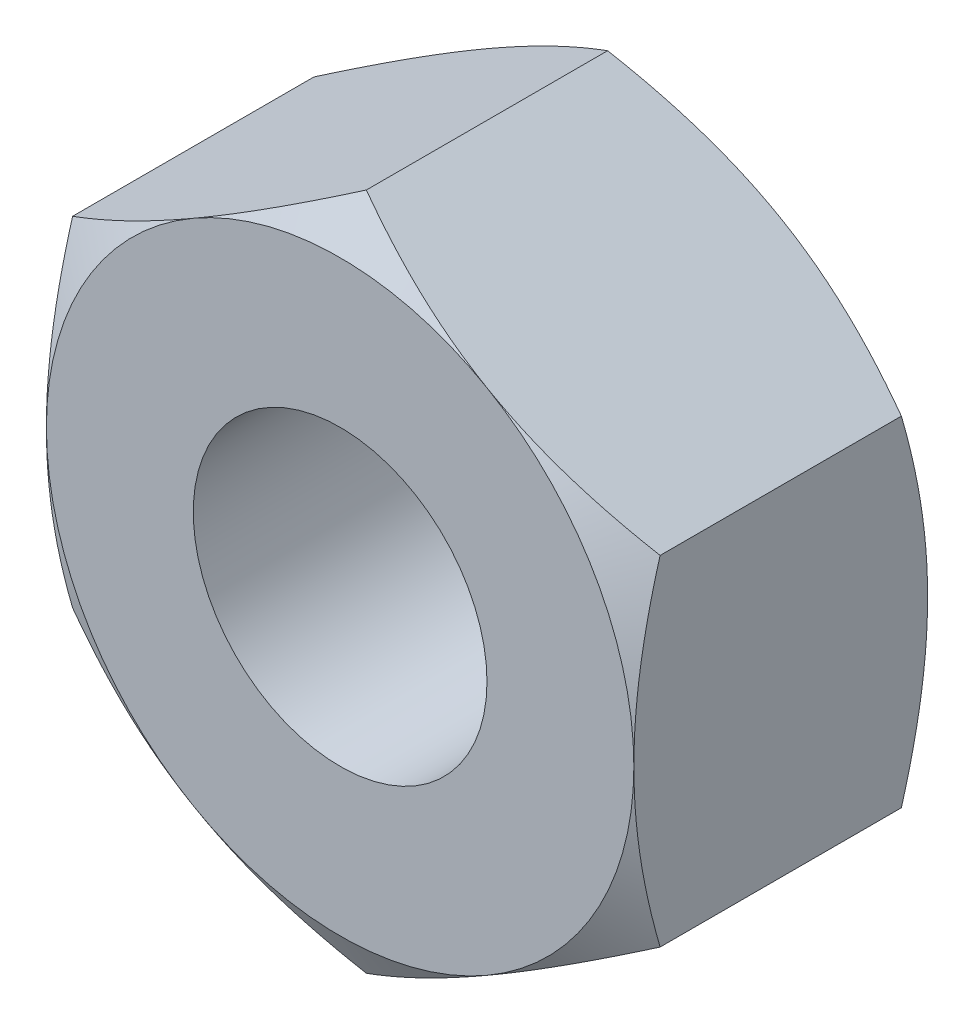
ISO-10303-21;
HEADER;
FILE_DESCRIPTION(('STEP AP214'),'2;1');
FILE_NAME('part.step','',(''),(''),'','','');
FILE_SCHEMA(('AUTOMOTIVE_DESIGN { 1 0 10303 214 1 1 1 1 }'));
ENDSEC;
DATA;
#1=APPLICATION_CONTEXT('core data for automotive mechanical design processes');
#2=APPLICATION_PROTOCOL_DEFINITION('international standard','automotive_design',2000,#1);
#3=PRODUCT_CONTEXT('',#1,'mechanical');
#4=PRODUCT('Part','Part','',(#3));
#5=PRODUCT_RELATED_PRODUCT_CATEGORY('part','',(#4));
#6=PRODUCT_DEFINITION_FORMATION('','',#4);
#7=PRODUCT_DEFINITION_CONTEXT('part definition',#1,'design');
#8=PRODUCT_DEFINITION('design','',#6,#7);
#9=PRODUCT_DEFINITION_SHAPE('','',#8);
#10=(LENGTH_UNIT() NAMED_UNIT(*) SI_UNIT(.MILLI.,.METRE.));
#11=(NAMED_UNIT(*) PLANE_ANGLE_UNIT() SI_UNIT($,.RADIAN.));
#12=(NAMED_UNIT(*) SI_UNIT($,.STERADIAN.) SOLID_ANGLE_UNIT());
#13=UNCERTAINTY_MEASURE_WITH_UNIT(LENGTH_MEASURE(1.E-05),#10,'distance_accuracy_value','');
#14=(GEOMETRIC_REPRESENTATION_CONTEXT(3) GLOBAL_UNCERTAINTY_ASSIGNED_CONTEXT((#13)) GLOBAL_UNIT_ASSIGNED_CONTEXT((#10,
#11,#12)) REPRESENTATION_CONTEXT('',''));
#15=CARTESIAN_POINT('',(0.,0.,0.));
#16=DIRECTION('',(0.,0.,1.));
#17=DIRECTION('',(1.,0.,0.));
#18=AXIS2_PLACEMENT_3D('',#15,#16,#17);
#19=CARTESIAN_POINT('',(-8.00000000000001,13.856406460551,0.));
#20=DIRECTION('',(0.,0.,-1.));
#21=DIRECTION('',(-1.,0.,0.));
#22=AXIS2_PLACEMENT_3D('',#19,#20,#21);
#23=PLANE('',#22);
#24=CARTESIAN_POINT('',(0.,0.,0.));
#25=DIRECTION('',(0.,0.,-1.));
#26=DIRECTION('',(-1.,0.,0.));
#27=AXIS2_PLACEMENT_3D('',#24,#25,#26);
#28=CIRCLE('',#27,8.);
#29=CARTESIAN_POINT('',(-7.99999999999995,0.,0.));
#30=VERTEX_POINT('',#29);
#31=CARTESIAN_POINT('',(-4.,6.92820323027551,0.));
#32=VERTEX_POINT('',#31);
#33=EDGE_CURVE('E405',#30,#32,#28,.T.);
#34=ORIENTED_EDGE('',*,*,#33,.F.);
#35=CARTESIAN_POINT('',(0.,0.,0.));
#36=DIRECTION('',(0.,0.,-1.));
#37=DIRECTION('',(-1.,0.,0.));
#38=AXIS2_PLACEMENT_3D('',#35,#36,#37);
#39=CIRCLE('',#38,8.);
#40=CARTESIAN_POINT('',(-3.99999999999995,-6.92820323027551,0.));
#41=VERTEX_POINT('',#40);
#42=EDGE_CURVE('E149',#30,#41,#39,.F.);
#43=ORIENTED_EDGE('',*,*,#42,.T.);
#44=CARTESIAN_POINT('',(4.,-6.92820323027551,0.));
#45=VERTEX_POINT('',#44);
#46=EDGE_CURVE('E251',#41,#45,#39,.F.);
#47=ORIENTED_EDGE('',*,*,#46,.T.);
#48=CARTESIAN_POINT('',(8.00000000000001,0.,0.));
#49=VERTEX_POINT('',#48);
#50=EDGE_CURVE('E153',#45,#49,#39,.F.);
#51=ORIENTED_EDGE('',*,*,#50,.T.);
#52=CARTESIAN_POINT('',(4.,6.92820323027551,0.));
#53=VERTEX_POINT('',#52);
#54=EDGE_CURVE('E127',#49,#53,#39,.F.);
#55=ORIENTED_EDGE('',*,*,#54,.T.);
#56=EDGE_CURVE('E140',#53,#32,#39,.F.);
#57=ORIENTED_EDGE('',*,*,#56,.T.);
#58=EDGE_LOOP('',(#34,#43,#47,#51,#55,#57));
#59=FACE_BOUND('',#58,.T.);
#60=CARTESIAN_POINT('',(0.,0.,0.));
#61=DIRECTION('',(0.,0.,1.));
#62=DIRECTION('',(1.,0.,0.));
#63=AXIS2_PLACEMENT_3D('',#60,#61,#62);
#64=CIRCLE('',#63,4.);
#65=CARTESIAN_POINT('',(4.,0.,0.));
#66=VERTEX_POINT('',#65);
#67=EDGE_CURVE('E398',#66,#66,#64,.T.);
#68=ORIENTED_EDGE('',*,*,#67,.F.);
#69=EDGE_LOOP('',(#68));
#70=FACE_BOUND('',#69,.T.);
#71=ADVANCED_FACE('F32',(#59,#70),#23,.F.);
#72=CARTESIAN_POINT('',(0.,0.,0.));
#73=DIRECTION('',(0.,0.,-1.));
#74=DIRECTION('',(-1.,0.,0.));
#75=AXIS2_PLACEMENT_3D('',#72,#73,#74);
#76=CONICAL_SURFACE('',#75,8.,1.0471975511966);
#77=CARTESIAN_POINT('',(-7.99999999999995,-12.4289414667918,-3.91502438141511));
#78=CARTESIAN_POINT('',(-7.99999999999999,-12.0792916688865,-3.74532345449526));
#79=CARTESIAN_POINT('',(-8.,-11.7288415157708,-3.57724345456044));
#80=CARTESIAN_POINT('',(-8.00000000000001,-11.0259148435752,-3.24523667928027));
#81=CARTESIAN_POINT('',(-8.00000000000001,-10.6734380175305,-3.081310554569));
#82=CARTESIAN_POINT('',(-8.00000000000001,-9.9642275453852,-2.75770323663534));
#83=CARTESIAN_POINT('',(-8.00000000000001,-9.60748118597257,-2.59804980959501));
#84=CARTESIAN_POINT('',(-8.00000000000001,-8.89115828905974,-2.28524838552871));
#85=CARTESIAN_POINT('',(-8.00000000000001,-8.5315818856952,-2.13210008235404));
#86=CARTESIAN_POINT('',(-8.00000000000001,-7.79743820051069,-1.82924542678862));
#87=CARTESIAN_POINT('',(-8.00000000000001,-7.42275986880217,-1.67980678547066));
#88=CARTESIAN_POINT('',(-8.00000000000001,-6.66902920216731,-1.39218569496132));
#89=CARTESIAN_POINT('',(-8.00000000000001,-6.28997638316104,-1.25400450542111));
#90=CARTESIAN_POINT('',(-8.00000000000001,-5.52759087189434,-0.992509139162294));
#91=CARTESIAN_POINT('',(-8.00000000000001,-5.14426853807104,-0.869165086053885));
#92=CARTESIAN_POINT('',(-8.00000000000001,-4.37213964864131,-0.641285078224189));
#93=CARTESIAN_POINT('',(-8.00000000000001,-3.98333485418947,-0.53674322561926));
#94=CARTESIAN_POINT('',(-8.00000000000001,-3.20206398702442,-0.352019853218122));
#95=CARTESIAN_POINT('',(-8.00000000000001,-2.80962942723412,-0.271708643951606));
#96=CARTESIAN_POINT('',(-8.00000000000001,-2.21738673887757,-0.172892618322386));
#97=CARTESIAN_POINT('',(-8.00000000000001,-2.01935997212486,-0.143561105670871));
#98=CARTESIAN_POINT('',(-8.00000000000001,-1.62231457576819,-0.0926897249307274));
#99=CARTESIAN_POINT('',(-8.00000000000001,-1.42329604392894,-0.071149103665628));
#100=CARTESIAN_POINT('',(-8.00000000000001,-1.02714522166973,-0.0365601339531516));
#101=CARTESIAN_POINT('',(-8.00000000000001,-0.830022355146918,-0.023404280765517));
#102=CARTESIAN_POINT('',(-8.00000000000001,-0.435396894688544,-0.00544139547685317));
#103=CARTESIAN_POINT('',(-8.00000000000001,-0.237894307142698,-0.000634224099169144));
#104=CARTESIAN_POINT('',(-8.00000000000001,0.157138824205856,0.000516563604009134));
#105=CARTESIAN_POINT('',(-8.00000000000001,0.354669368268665,-0.003139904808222));
#106=CARTESIAN_POINT('',(-8.00000000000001,0.74940013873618,-0.0188268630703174));
#107=CARTESIAN_POINT('',(-8.00000000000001,0.946600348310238,-0.0308577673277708));
#108=CARTESIAN_POINT('',(-8.00000000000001,1.41976781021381,-0.0695170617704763));
#109=CARTESIAN_POINT('',(-8.00000000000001,1.69542073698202,-0.10007616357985));
#110=CARTESIAN_POINT('',(-8.00000000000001,2.24468314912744,-0.17589611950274));
#111=CARTESIAN_POINT('',(-8.00000000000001,2.51829235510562,-0.22115894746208));
#112=CARTESIAN_POINT('',(-8.00000000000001,3.33573277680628,-0.376603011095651));
#113=CARTESIAN_POINT('',(-8.00000000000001,3.87588099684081,-0.506412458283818));
#114=CARTESIAN_POINT('',(-8.00000000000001,4.68375598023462,-0.731593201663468));
#115=CARTESIAN_POINT('',(-8.00000000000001,4.95566805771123,-0.812812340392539));
#116=CARTESIAN_POINT('',(-8.00000000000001,5.49685040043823,-0.983699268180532));
#117=CARTESIAN_POINT('',(-8.00000000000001,5.76612064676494,-1.07336711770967));
#118=CARTESIAN_POINT('',(-8.00000000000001,6.30210618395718,-1.25971133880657));
#119=CARTESIAN_POINT('',(-8.00000000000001,6.56882226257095,-1.35638546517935));
#120=CARTESIAN_POINT('',(-8.00000000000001,7.10004114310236,-1.55560318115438));
#121=CARTESIAN_POINT('',(-8.00000000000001,7.36454398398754,-1.65814666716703));
#122=CARTESIAN_POINT('',(-8.00000000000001,8.0395486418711,-1.92707319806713));
#123=CARTESIAN_POINT('',(-8.00000000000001,8.44864651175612,-2.0969756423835));
#124=CARTESIAN_POINT('',(-8.00000000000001,9.26296702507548,-2.44585611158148));
#125=CARTESIAN_POINT('',(-8.00000000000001,9.66818933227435,-2.62483491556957));
#126=CARTESIAN_POINT('',(-8.00000000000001,10.4755817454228,-2.98985031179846));
#127=CARTESIAN_POINT('',(-8.00000000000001,10.87775088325,-3.1758890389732));
#128=CARTESIAN_POINT('',(-8.00000000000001,11.6794880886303,-3.55344155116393));
#129=CARTESIAN_POINT('',(-8.00000000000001,12.0790562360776,-3.74495516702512));
#130=CARTESIAN_POINT('',(-8.00000000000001,12.8766152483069,-4.13259501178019));
#131=CARTESIAN_POINT('',(-8.00000000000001,13.274603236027,-4.32872714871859));
#132=CARTESIAN_POINT('',(-8.00000000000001,14.068831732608,-4.72449899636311));
#133=CARTESIAN_POINT('',(-8.00000000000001,14.465072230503,-4.92413872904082));
#134=CARTESIAN_POINT('',(-8.00000000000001,15.2560315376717,-5.32623624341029));
#135=CARTESIAN_POINT('',(-8.00000000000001,15.650750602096,-5.52869352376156));
#136=CARTESIAN_POINT('',(-8.00000000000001,16.4389741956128,-5.93595999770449));
#137=CARTESIAN_POINT('',(-8.00000000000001,16.8324787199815,-6.14076920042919));
#138=CARTESIAN_POINT('',(-8.00000000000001,17.9357396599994,-6.71846514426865));
#139=CARTESIAN_POINT('',(-8.00000000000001,18.6443410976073,-7.09355729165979));
#140=CARTESIAN_POINT('',(-8.00000000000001,20.0590897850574,-7.84841354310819));
#141=CARTESIAN_POINT('',(-8.00000000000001,20.7652369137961,-8.22817787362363));
#142=CARTESIAN_POINT('',(-8.00000000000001,22.1735698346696,-8.99010012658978));
#143=CARTESIAN_POINT('',(-8.00000000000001,22.875761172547,-9.37224780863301));
#144=CARTESIAN_POINT('',(-8.,24.2786001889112,-10.1392568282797));
#145=CARTESIAN_POINT('',(-7.99999999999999,24.9792479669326,-10.5241179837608));
#146=CARTESIAN_POINT('',(-7.99999999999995,25.6793433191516,-10.9099740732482));
#147=B_SPLINE_CURVE_WITH_KNOTS('',3,(#77,#78,#79,#80,#81,#82,#83,#84,#85,#86,#87,#88,#89,#90,
#91,#92,#93,#94,#95,#96,#97,#98,#99,#100,#101,#102,#103,#104,#105,#106,#107,#108,#109,#110,#111,
#112,#113,#114,#115,#116,#117,#118,#119,#120,#121,#122,#123,#124,#125,#126,#127,#128,#129,#130,
#131,#132,#133,#134,#135,#136,#137,#138,#139,#140,#141,#142,#143,#144,#145,#146),.UNSPECIFIED.,
.F.,.F.,(4,2,2,2,2,2,2,2,2,2,2,2,2,2,2,2,2,2,2,2,2,2,2,2,2,2,2,2,2,2,2,2,2,2,4),(0.,
1.16598174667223,2.33214500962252,3.50461785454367,4.67703545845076,5.88703631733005,
7.09717238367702,8.30482938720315,9.51210690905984,10.7128031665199,11.3132358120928,
11.9136103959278,12.5061236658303,13.0986270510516,13.6911363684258,14.2836750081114,
15.1152308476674,15.9468983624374,17.6111205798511,18.4623977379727,19.3136809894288,
20.1646926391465,21.0156892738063,22.3444603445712,23.6733456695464,25.0026361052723,
26.3318855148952,27.6629391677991,28.9940011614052,30.3248292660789,31.6556625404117,
34.0608989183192,36.4662523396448,38.8645752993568,41.2627387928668),.UNSPECIFIED.);
#148=CARTESIAN_POINT('',(-8.00000000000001,4.61880215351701,-0.714531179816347));
#149=VERTEX_POINT('',#148);
#150=EDGE_CURVE('E158',#149,#30,#147,.F.);
#151=ORIENTED_EDGE('',*,*,#150,.T.);
#152=ORIENTED_EDGE('',*,*,#33,.T.);
#153=CARTESIAN_POINT('',(0.000200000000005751,9.23771977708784,-0.714597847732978));
#154=CARTESIAN_POINT('',(-0.17564878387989,9.13619343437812,-0.6559907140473));
#155=CARTESIAN_POINT('',(-0.352153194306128,9.03428856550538,-0.600043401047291));
#156=CARTESIAN_POINT('',(-0.70659546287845,8.82965122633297,-0.494201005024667));
#157=CARTESIAN_POINT('',(-0.884533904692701,8.72691841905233,-0.444308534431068));
#158=CARTESIAN_POINT('',(-1.42119823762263,8.41707512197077,-0.304692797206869));
#159=CARTESIAN_POINT('',(-1.7820425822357,8.20874154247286,-0.225281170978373));
#160=CARTESIAN_POINT('',(-2.32203917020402,7.89697436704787,-0.132161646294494));
#161=CARTESIAN_POINT('',(-2.49957818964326,7.79447216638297,-0.105634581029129));
#162=CARTESIAN_POINT('',(-2.85545911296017,7.58900421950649,-0.0611531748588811));
#163=CARTESIAN_POINT('',(-3.0338009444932,7.48603851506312,-0.043198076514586));
#164=CARTESIAN_POINT('',(-3.39079168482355,7.27992981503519,-0.0163156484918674));
#165=CARTESIAN_POINT('',(-3.56944001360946,7.17678715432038,-0.00737807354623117));
#166=CARTESIAN_POINT('',(-3.92690170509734,6.97040655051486,0.00127769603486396));
#167=CARTESIAN_POINT('',(-4.10571506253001,6.86716861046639,0.000996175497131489));
#168=CARTESIAN_POINT('',(-4.44001336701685,6.67416139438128,-0.00814502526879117));
#169=CARTESIAN_POINT('',(-4.59552190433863,6.58437849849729,-0.0158896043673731));
#170=CARTESIAN_POINT('',(-4.90617476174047,6.40502298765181,-0.0382011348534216));
#171=CARTESIAN_POINT('',(-5.06131905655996,6.31545038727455,-0.0527685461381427));
#172=CARTESIAN_POINT('',(-5.52615131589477,6.04707935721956,-0.106360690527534));
#173=CARTESIAN_POINT('',(-5.83501648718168,5.86875596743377,-0.155268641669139));
#174=CARTESIAN_POINT('',(-6.45602322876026,5.51021755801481,-0.277539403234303));
#175=CARTESIAN_POINT('',(-6.76808554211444,5.33004829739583,-0.351420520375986));
#176=CARTESIAN_POINT('',(-7.38755648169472,4.972396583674,-0.519100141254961));
#177=CARTESIAN_POINT('',(-7.69497304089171,4.79490955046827,-0.612859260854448));
#178=CARTESIAN_POINT('',(-8.00019999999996,4.61868668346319,-0.714597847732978));
#179=B_SPLINE_CURVE_WITH_KNOTS('',3,(#153,#154,#155,#156,#157,#158,#159,#160,#161,#162,#163,
#164,#165,#166,#167,#168,#169,#170,#171,#172,#173,#174,#175,#176,#177,#178),.UNSPECIFIED.,.F.,
.F.,(4,2,2,2,2,2,2,2,2,2,2,2,4),(0.,0.633973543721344,1.26821965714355,2.53934712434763,
3.15934343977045,3.77928496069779,4.39852133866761,5.0177385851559,5.55680239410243,
6.09590254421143,7.1748707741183,8.27776850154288,9.3785011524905),.UNSPECIFIED.);
#180=EDGE_CURVE('E190',#32,#149,#179,.T.);
#181=ORIENTED_EDGE('',*,*,#180,.T.);
#182=EDGE_LOOP('',(#151,#152,#181));
#183=FACE_BOUND('',#182,.T.);
#184=ADVANCED_FACE('F177',(#183),#76,.T.);
#185=CARTESIAN_POINT('',(8.00020000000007,4.61868668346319,-0.714597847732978));
#186=CARTESIAN_POINT('',(7.82435121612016,4.7202130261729,-0.655990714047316));
#187=CARTESIAN_POINT('',(7.64784680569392,4.82211789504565,-0.600043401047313));
#188=CARTESIAN_POINT('',(7.29340453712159,5.02675523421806,-0.494201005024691));
#189=CARTESIAN_POINT('',(7.11546609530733,5.1294880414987,-0.444308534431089));
#190=CARTESIAN_POINT('',(6.5788017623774,5.43933133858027,-0.304692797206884));
#191=CARTESIAN_POINT('',(6.21795741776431,5.64766491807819,-0.225281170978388));
#192=CARTESIAN_POINT('',(5.67796082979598,5.95943209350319,-0.132161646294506));
#193=CARTESIAN_POINT('',(5.50042181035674,6.06193429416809,-0.105634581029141));
#194=CARTESIAN_POINT('',(5.14454088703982,6.26740224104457,-0.0611531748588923));
#195=CARTESIAN_POINT('',(4.96619905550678,6.37036794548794,-0.0431980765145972));
#196=CARTESIAN_POINT('',(4.60920831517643,6.57647664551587,-0.0163156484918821));
#197=CARTESIAN_POINT('',(4.43055998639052,6.6796193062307,-0.00737807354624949));
#198=CARTESIAN_POINT('',(4.07309829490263,6.8859999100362,0.00127769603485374));
#199=CARTESIAN_POINT('',(3.89428493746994,6.98923785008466,0.000996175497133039));
#200=CARTESIAN_POINT('',(3.5599866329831,7.18224506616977,-0.00814502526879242));
#201=CARTESIAN_POINT('',(3.40447809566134,7.27202796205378,-0.0158896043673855));
#202=CARTESIAN_POINT('',(3.0938252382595,7.45138347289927,-0.0382011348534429));
#203=CARTESIAN_POINT('',(2.93868094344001,7.54095607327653,-0.0527685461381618));
#204=CARTESIAN_POINT('',(2.47384868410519,7.80932710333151,-0.10636069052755));
#205=CARTESIAN_POINT('',(2.16498351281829,7.9876504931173,-0.155268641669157));
#206=CARTESIAN_POINT('',(1.54397677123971,8.34618890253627,-0.277539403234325));
#207=CARTESIAN_POINT('',(1.23191445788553,8.52635816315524,-0.35142052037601));
#208=CARTESIAN_POINT('',(0.61244351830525,8.88400987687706,-0.51910014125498));
#209=CARTESIAN_POINT('',(0.305026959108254,9.06149691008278,-0.612859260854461));
#210=CARTESIAN_POINT('',(-0.000200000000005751,9.23771977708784,-0.714597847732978));
#211=B_SPLINE_CURVE_WITH_KNOTS('',3,(#185,#186,#187,#188,#189,#190,#191,#192,#193,#194,#195,
#196,#197,#198,#199,#200,#201,#202,#203,#204,#205,#206,#207,#208,#209,#210),.UNSPECIFIED.,.F.,
.F.,(4,2,2,2,2,2,2,2,2,2,2,2,4),(0.,0.633973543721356,1.26821965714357,2.53934712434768,
3.15934343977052,3.77928496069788,4.3985213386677,5.017738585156,5.55680239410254,
6.09590254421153,7.1748707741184,8.27776850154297,9.37850115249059),.UNSPECIFIED.);
#212=CARTESIAN_POINT('',(0.,9.23760430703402,-0.714531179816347));
#213=VERTEX_POINT('',#212);
#214=EDGE_CURVE('E136',#53,#213,#211,.T.);
#215=ORIENTED_EDGE('',*,*,#214,.T.);
#216=EDGE_CURVE('E143',#213,#32,#179,.T.);
#217=ORIENTED_EDGE('',*,*,#216,.T.);
#218=ORIENTED_EDGE('',*,*,#56,.F.);
#219=EDGE_LOOP('',(#215,#217,#218));
#220=FACE_BOUND('',#219,.T.);
#221=ADVANCED_FACE('F141',(#220),#76,.T.);
#222=CARTESIAN_POINT('',(8.00000000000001,-12.4289414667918,-3.91502438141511));
#223=CARTESIAN_POINT('',(8.00000000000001,-12.0792916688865,-3.74532345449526));
#224=CARTESIAN_POINT('',(8.00000000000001,-11.7288415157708,-3.57724345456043));
#225=CARTESIAN_POINT('',(8.00000000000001,-11.0259148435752,-3.24523667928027));
#226=CARTESIAN_POINT('',(8.00000000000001,-10.6734380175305,-3.081310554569));
#227=CARTESIAN_POINT('',(8.00000000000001,-9.96422754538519,-2.75770323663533));
#228=CARTESIAN_POINT('',(8.00000000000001,-9.60748118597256,-2.598049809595));
#229=CARTESIAN_POINT('',(8.00000000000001,-8.89115828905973,-2.2852483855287));
#230=CARTESIAN_POINT('',(8.00000000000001,-8.53158188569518,-2.13210008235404));
#231=CARTESIAN_POINT('',(8.00000000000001,-7.79743820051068,-1.82924542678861));
#232=CARTESIAN_POINT('',(8.00000000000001,-7.42275986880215,-1.67980678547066));
#233=CARTESIAN_POINT('',(8.00000000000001,-6.66902920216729,-1.39218569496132));
#234=CARTESIAN_POINT('',(8.00000000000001,-6.28997638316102,-1.2540045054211));
#235=CARTESIAN_POINT('',(8.00000000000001,-5.52759087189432,-0.992509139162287));
#236=CARTESIAN_POINT('',(8.00000000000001,-5.14426853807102,-0.869165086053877));
#237=CARTESIAN_POINT('',(8.00000000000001,-4.37213964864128,-0.641285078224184));
#238=CARTESIAN_POINT('',(8.00000000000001,-3.98333485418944,-0.53674322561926));
#239=CARTESIAN_POINT('',(8.00000000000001,-3.20206398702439,-0.352019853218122));
#240=CARTESIAN_POINT('',(8.00000000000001,-2.8096294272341,-0.271708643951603));
#241=CARTESIAN_POINT('',(8.00000000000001,-2.21738673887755,-0.172892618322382));
#242=CARTESIAN_POINT('',(8.00000000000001,-2.01935997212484,-0.143561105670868));
#243=CARTESIAN_POINT('',(8.00000000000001,-1.62231457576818,-0.0926897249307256));
#244=CARTESIAN_POINT('',(8.00000000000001,-1.42329604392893,-0.0711491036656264));
#245=CARTESIAN_POINT('',(8.00000000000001,-1.02714522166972,-0.0365601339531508));
#246=CARTESIAN_POINT('',(8.00000000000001,-0.830022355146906,-0.0234042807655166));
#247=CARTESIAN_POINT('',(8.00000000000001,-0.435396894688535,-0.00544139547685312));
#248=CARTESIAN_POINT('',(8.00000000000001,-0.237894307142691,-0.000634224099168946));
#249=CARTESIAN_POINT('',(8.00000000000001,0.157138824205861,0.000516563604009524));
#250=CARTESIAN_POINT('',(8.00000000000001,0.354669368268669,-0.0031399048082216));
#251=CARTESIAN_POINT('',(8.00000000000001,0.749400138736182,-0.0188268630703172));
#252=CARTESIAN_POINT('',(8.00000000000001,0.946600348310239,-0.0308577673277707));
#253=CARTESIAN_POINT('',(8.00000000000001,1.41976781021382,-0.0695170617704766));
#254=CARTESIAN_POINT('',(8.00000000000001,1.69542073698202,-0.100076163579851));
#255=CARTESIAN_POINT('',(8.00000000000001,2.24468314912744,-0.175896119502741));
#256=CARTESIAN_POINT('',(8.00000000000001,2.51829235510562,-0.221158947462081));
#257=CARTESIAN_POINT('',(8.00000000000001,3.3357327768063,-0.376603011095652));
#258=CARTESIAN_POINT('',(8.00000000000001,3.87588099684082,-0.506412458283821));
#259=CARTESIAN_POINT('',(8.00000000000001,4.68375598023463,-0.731593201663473));
#260=CARTESIAN_POINT('',(8.00000000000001,4.95566805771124,-0.812812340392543));
#261=CARTESIAN_POINT('',(8.00000000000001,5.49685040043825,-0.983699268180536));
#262=CARTESIAN_POINT('',(8.00000000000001,5.76612064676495,-1.07336711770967));
#263=CARTESIAN_POINT('',(8.00000000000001,6.3021061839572,-1.25971133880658));
#264=CARTESIAN_POINT('',(8.00000000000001,6.56882226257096,-1.35638546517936));
#265=CARTESIAN_POINT('',(8.00000000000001,7.10004114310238,-1.55560318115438));
#266=CARTESIAN_POINT('',(8.00000000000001,7.36454398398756,-1.65814666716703));
#267=CARTESIAN_POINT('',(8.00000000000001,8.03954864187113,-1.92707319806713));
#268=CARTESIAN_POINT('',(8.00000000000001,8.44864651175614,-2.09697564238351));
#269=CARTESIAN_POINT('',(8.00000000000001,9.2629670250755,-2.4458561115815));
#270=CARTESIAN_POINT('',(8.00000000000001,9.66818933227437,-2.62483491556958));
#271=CARTESIAN_POINT('',(8.00000000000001,10.4755817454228,-2.98985031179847));
#272=CARTESIAN_POINT('',(8.00000000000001,10.87775088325,-3.17588903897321));
#273=CARTESIAN_POINT('',(8.00000000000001,11.6794880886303,-3.55344155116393));
#274=CARTESIAN_POINT('',(8.00000000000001,12.0790562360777,-3.74495516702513));
#275=CARTESIAN_POINT('',(8.00000000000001,12.8766152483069,-4.1325950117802));
#276=CARTESIAN_POINT('',(8.00000000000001,13.274603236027,-4.3287271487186));
#277=CARTESIAN_POINT('',(8.00000000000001,14.068831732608,-4.72449899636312));
#278=CARTESIAN_POINT('',(8.00000000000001,14.4650722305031,-4.92413872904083));
#279=CARTESIAN_POINT('',(8.00000000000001,15.2560315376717,-5.3262362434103));
#280=CARTESIAN_POINT('',(8.00000000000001,15.650750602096,-5.52869352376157));
#281=CARTESIAN_POINT('',(8.00000000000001,16.4389741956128,-5.93595999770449));
#282=CARTESIAN_POINT('',(8.00000000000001,16.8324787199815,-6.1407692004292));
#283=CARTESIAN_POINT('',(8.00000000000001,17.9357396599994,-6.71846514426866));
#284=CARTESIAN_POINT('',(8.00000000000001,18.6443410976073,-7.0935572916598));
#285=CARTESIAN_POINT('',(8.00000000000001,20.0590897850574,-7.8484135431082));
#286=CARTESIAN_POINT('',(8.00000000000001,20.7652369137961,-8.22817787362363));
#287=CARTESIAN_POINT('',(8.,22.1735698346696,-8.99010012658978));
#288=CARTESIAN_POINT('',(8.,22.875761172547,-9.37224780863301));
#289=CARTESIAN_POINT('',(8.00000000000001,24.2786001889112,-10.1392568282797));
#290=CARTESIAN_POINT('',(8.00000000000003,24.9792479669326,-10.5241179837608));
#291=CARTESIAN_POINT('',(8.00000000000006,25.6793433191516,-10.9099740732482));
#292=B_SPLINE_CURVE_WITH_KNOTS('',3,(#222,#223,#224,#225,#226,#227,#228,#229,#230,#231,#232,
#233,#234,#235,#236,#237,#238,#239,#240,#241,#242,#243,#244,#245,#246,#247,#248,#249,#250,#251,
#252,#253,#254,#255,#256,#257,#258,#259,#260,#261,#262,#263,#264,#265,#266,#267,#268,#269,#270,
#271,#272,#273,#274,#275,#276,#277,#278,#279,#280,#281,#282,#283,#284,#285,#286,#287,#288,#289,
#290,#291),.UNSPECIFIED.,.F.,.F.,(4,2,2,2,2,2,2,2,2,2,2,2,2,2,2,2,2,2,2,2,2,2,2,2,2,2,2,2,2,2,2,
2,2,2,4),(0.,1.16598174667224,2.33214500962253,3.50461785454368,4.67703545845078,
5.88703631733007,7.09717238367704,8.30482938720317,9.51210690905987,10.7128031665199,
11.3132358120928,11.9136103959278,12.5061236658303,13.0986270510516,13.6911363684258,
14.2836750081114,15.1152308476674,15.9468983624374,17.6111205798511,18.4623977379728,
19.3136809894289,20.1646926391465,21.0156892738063,22.3444603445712,23.6733456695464,
25.0026361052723,26.3318855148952,27.6629391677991,28.9940011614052,30.3248292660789,
31.6556625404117,34.0608989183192,36.4662523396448,38.8645752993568,41.2627387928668),.UNSPECIFIED.);
#293=CARTESIAN_POINT('',(8.00000000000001,4.61880215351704,-0.714531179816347));
#294=VERTEX_POINT('',#293);
#295=EDGE_CURVE('E130',#49,#294,#292,.T.);
#296=ORIENTED_EDGE('',*,*,#295,.T.);
#297=EDGE_CURVE('E123',#294,#53,#211,.T.);
#298=ORIENTED_EDGE('',*,*,#297,.T.);
#299=ORIENTED_EDGE('',*,*,#54,.F.);
#300=EDGE_LOOP('',(#296,#298,#299));
#301=FACE_BOUND('',#300,.T.);
#302=ADVANCED_FACE('F125',(#301),#76,.T.);
#303=CARTESIAN_POINT('',(-0.00019999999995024,-9.23771977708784,-0.714597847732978));
#304=CARTESIAN_POINT('',(0.175648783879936,-9.13619343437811,-0.655990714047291));
#305=CARTESIAN_POINT('',(0.352153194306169,-9.03428856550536,-0.60004340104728));
#306=CARTESIAN_POINT('',(0.706595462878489,-8.82965122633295,-0.494201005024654));
#307=CARTESIAN_POINT('',(0.88453390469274,-8.72691841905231,-0.444308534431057));
#308=CARTESIAN_POINT('',(1.42119823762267,-8.41707512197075,-0.304692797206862));
#309=CARTESIAN_POINT('',(1.78204258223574,-8.20874154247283,-0.225281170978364));
#310=CARTESIAN_POINT('',(2.32203917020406,-7.89697436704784,-0.132161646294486));
#311=CARTESIAN_POINT('',(2.4995781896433,-7.79447216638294,-0.105634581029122));
#312=CARTESIAN_POINT('',(2.85545911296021,-7.58900421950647,-0.0611531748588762));
#313=CARTESIAN_POINT('',(3.03380094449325,-7.4860385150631,-0.0431980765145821));
#314=CARTESIAN_POINT('',(3.3907916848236,-7.27992981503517,-0.0163156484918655));
#315=CARTESIAN_POINT('',(3.5694400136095,-7.17678715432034,-0.00737807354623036));
#316=CARTESIAN_POINT('',(3.92690170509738,-6.97040655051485,0.00127769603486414));
#317=CARTESIAN_POINT('',(4.10571506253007,-6.86716861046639,0.000996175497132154));
#318=CARTESIAN_POINT('',(4.44001336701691,-6.67416139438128,-0.00814502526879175));
#319=CARTESIAN_POINT('',(4.59552190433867,-6.58437849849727,-0.0158896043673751));
#320=CARTESIAN_POINT('',(4.90617476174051,-6.40502298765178,-0.0382011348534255));
#321=CARTESIAN_POINT('',(5.06131905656,-6.31545038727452,-0.0527685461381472));
#322=CARTESIAN_POINT('',(5.52615131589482,-6.04707935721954,-0.106360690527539));
#323=CARTESIAN_POINT('',(5.83501648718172,-5.86875596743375,-0.155268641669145));
#324=CARTESIAN_POINT('',(6.4560232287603,-5.51021755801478,-0.277539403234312));
#325=CARTESIAN_POINT('',(6.76808554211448,-5.33004829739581,-0.351420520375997));
#326=CARTESIAN_POINT('',(7.38755648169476,-4.97239658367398,-0.51910014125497));
#327=CARTESIAN_POINT('',(7.69497304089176,-4.79490955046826,-0.612859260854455));
#328=CARTESIAN_POINT('',(8.00020000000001,-4.61868668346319,-0.714597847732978));
#329=B_SPLINE_CURVE_WITH_KNOTS('',3,(#303,#304,#305,#306,#307,#308,#309,#310,#311,#312,#313,
#314,#315,#316,#317,#318,#319,#320,#321,#322,#323,#324,#325,#326,#327,#328),.UNSPECIFIED.,.F.,
.F.,(4,2,2,2,2,2,2,2,2,2,2,2,4),(0.,0.633973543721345,1.26821965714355,2.53934712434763,
3.15934343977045,3.7792849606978,4.39852133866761,5.0177385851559,5.55680239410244,
6.09590254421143,7.1748707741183,8.27776850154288,9.3785011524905),.UNSPECIFIED.);
#330=CARTESIAN_POINT('',(8.00000000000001,-4.61880215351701,-0.714531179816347));
#331=VERTEX_POINT('',#330);
#332=EDGE_CURVE('E204',#45,#331,#329,.T.);
#333=ORIENTED_EDGE('',*,*,#332,.T.);
#334=EDGE_CURVE('E203',#331,#49,#292,.T.);
#335=ORIENTED_EDGE('',*,*,#334,.T.);
#336=ORIENTED_EDGE('',*,*,#50,.F.);
#337=EDGE_LOOP('',(#333,#335,#336));
#338=FACE_BOUND('',#337,.T.);
#339=ADVANCED_FACE('F334',(#338),#76,.T.);
#340=CARTESIAN_POINT('',(0.,-9.23760430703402,-0.714531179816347));
#341=VERTEX_POINT('',#340);
#342=EDGE_CURVE('E261',#341,#45,#329,.T.);
#343=ORIENTED_EDGE('',*,*,#342,.T.);
#344=ORIENTED_EDGE('',*,*,#46,.F.);
#345=CARTESIAN_POINT('',(-8.00020000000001,-4.61868668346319,-0.714597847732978));
#346=CARTESIAN_POINT('',(-7.82435121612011,-4.7202130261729,-0.655990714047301));
#347=CARTESIAN_POINT('',(-7.64784680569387,-4.82211789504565,-0.600043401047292));
#348=CARTESIAN_POINT('',(-7.29340453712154,-5.02675523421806,-0.494201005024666));
#349=CARTESIAN_POINT('',(-7.11546609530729,-5.1294880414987,-0.444308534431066));
#350=CARTESIAN_POINT('',(-6.57880176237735,-5.43933133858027,-0.304692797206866));
#351=CARTESIAN_POINT('',(-6.21795741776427,-5.64766491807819,-0.225281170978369));
#352=CARTESIAN_POINT('',(-5.67796082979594,-5.95943209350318,-0.132161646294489));
#353=CARTESIAN_POINT('',(-5.5004218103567,-6.06193429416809,-0.105634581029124));
#354=CARTESIAN_POINT('',(-5.14454088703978,-6.26740224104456,-0.0611531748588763));
#355=CARTESIAN_POINT('',(-4.96619905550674,-6.37036794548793,-0.0431980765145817));
#356=CARTESIAN_POINT('',(-4.60920831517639,-6.57647664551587,-0.0163156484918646));
#357=CARTESIAN_POINT('',(-4.43055998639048,-6.6796193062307,-0.00737807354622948));
#358=CARTESIAN_POINT('',(-4.07309829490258,-6.88599991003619,0.00127769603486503));
#359=CARTESIAN_POINT('',(-3.89428493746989,-6.98923785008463,0.000996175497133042));
#360=CARTESIAN_POINT('',(-3.55998663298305,-7.18224506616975,-0.00814502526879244));
#361=CARTESIAN_POINT('',(-3.40447809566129,-7.27202796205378,-0.015889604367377));
#362=CARTESIAN_POINT('',(-3.09382523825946,-7.45138347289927,-0.0382011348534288));
#363=CARTESIAN_POINT('',(-2.93868094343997,-7.54095607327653,-0.0527685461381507));
#364=CARTESIAN_POINT('',(-2.47384868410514,-7.8093271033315,-0.106360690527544));
#365=CARTESIAN_POINT('',(-2.16498351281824,-7.9876504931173,-0.15526864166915));
#366=CARTESIAN_POINT('',(-1.54397677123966,-8.34618890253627,-0.277539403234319));
#367=CARTESIAN_POINT('',(-1.23191445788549,-8.52635816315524,-0.351420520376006));
#368=CARTESIAN_POINT('',(-0.612443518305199,-8.88400987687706,-0.519100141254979));
#369=CARTESIAN_POINT('',(-0.305026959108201,-9.06149691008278,-0.612859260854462));
#370=CARTESIAN_POINT('',(0.000200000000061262,-9.23771977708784,-0.714597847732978));
#371=B_SPLINE_CURVE_WITH_KNOTS('',3,(#345,#346,#347,#348,#349,#350,#351,#352,#353,#354,#355,
#356,#357,#358,#359,#360,#361,#362,#363,#364,#365,#366,#367,#368,#369,#370),.UNSPECIFIED.,.F.,
.F.,(4,2,2,2,2,2,2,2,2,2,2,2,4),(0.,0.633973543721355,1.26821965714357,2.53934712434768,
3.15934343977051,3.77928496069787,4.39852133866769,5.01773858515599,5.55680239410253,
6.09590254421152,7.17487077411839,8.27776850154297,9.3785011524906),.UNSPECIFIED.);
#372=EDGE_CURVE('E265',#41,#341,#371,.T.);
#373=ORIENTED_EDGE('',*,*,#372,.T.);
#374=EDGE_LOOP('',(#343,#344,#373));
#375=FACE_BOUND('',#374,.T.);
#376=ADVANCED_FACE('F183',(#375),#76,.T.);
#377=CARTESIAN_POINT('',(-8.00000000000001,-4.61880215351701,-0.714531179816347));
#378=VERTEX_POINT('',#377);
#379=EDGE_CURVE('E171',#378,#41,#371,.T.);
#380=ORIENTED_EDGE('',*,*,#379,.T.);
#381=ORIENTED_EDGE('',*,*,#42,.F.);
#382=EDGE_CURVE('E135',#30,#378,#147,.F.);
#383=ORIENTED_EDGE('',*,*,#382,.T.);
#384=EDGE_LOOP('',(#380,#381,#383));
#385=FACE_BOUND('',#384,.T.);
#386=ADVANCED_FACE('F270',(#385),#76,.T.);
#387=CARTESIAN_POINT('',(8.00000000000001,4.61880215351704,-8.00000000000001));
#388=DIRECTION('',(0.499999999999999,0.866025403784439,0.));
#389=DIRECTION('',(-0.866025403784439,0.499999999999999,0.));
#390=AXIS2_PLACEMENT_3D('',#387,#388,#389);
#391=PLANE('',#390);
#392=CARTESIAN_POINT('',(-0.000200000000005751,9.23771977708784,-7.28540215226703));
#393=CARTESIAN_POINT('',(0.175648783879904,9.13619343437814,-7.3440092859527));
#394=CARTESIAN_POINT('',(0.352153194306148,9.0342885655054,-7.39995659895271));
#395=CARTESIAN_POINT('',(0.70659546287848,8.82965122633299,-7.50579899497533));
#396=CARTESIAN_POINT('',(0.884533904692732,8.72691841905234,-7.55569146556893));
#397=CARTESIAN_POINT('',(1.42119823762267,8.41707512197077,-7.69530720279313));
#398=CARTESIAN_POINT('',(1.78204258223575,8.20874154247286,-7.77471882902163));
#399=CARTESIAN_POINT('',(2.32203917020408,7.89697436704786,-7.86783835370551));
#400=CARTESIAN_POINT('',(2.49957818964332,7.79447216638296,-7.89436541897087));
#401=CARTESIAN_POINT('',(2.85545911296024,7.58900421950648,-7.93884682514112));
#402=CARTESIAN_POINT('',(3.03380094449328,7.48603851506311,-7.95680192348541));
#403=CARTESIAN_POINT('',(3.39079168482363,7.27992981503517,-7.98368435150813));
#404=CARTESIAN_POINT('',(3.56944001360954,7.17678715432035,-7.99262192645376));
#405=CARTESIAN_POINT('',(3.92690170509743,6.97040655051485,-8.00127769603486));
#406=CARTESIAN_POINT('',(4.10571506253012,6.8671686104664,-8.00099617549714));
#407=CARTESIAN_POINT('',(4.44001336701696,6.67416139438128,-7.99185497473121));
#408=CARTESIAN_POINT('',(4.59552190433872,6.58437849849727,-7.98411039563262));
#409=CARTESIAN_POINT('',(4.90617476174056,6.40502298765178,-7.96179886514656));
#410=CARTESIAN_POINT('',(5.06131905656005,6.31545038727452,-7.94723145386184));
#411=CARTESIAN_POINT('',(5.52615131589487,6.04707935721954,-7.89363930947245));
#412=CARTESIAN_POINT('',(5.83501648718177,5.86875596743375,-7.84473135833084));
#413=CARTESIAN_POINT('',(6.45602322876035,5.51021755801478,-7.72246059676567));
#414=CARTESIAN_POINT('',(6.76808554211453,5.33004829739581,-7.64857947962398));
#415=CARTESIAN_POINT('',(7.38755648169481,4.97239658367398,-7.48089985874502));
#416=CARTESIAN_POINT('',(7.69497304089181,4.79490955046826,-7.38714073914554));
#417=CARTESIAN_POINT('',(8.00020000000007,4.61868668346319,-7.28540215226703));
#418=B_SPLINE_CURVE_WITH_KNOTS('',3,(#392,#393,#394,#395,#396,#397,#398,#399,#400,#401,#402,
#403,#404,#405,#406,#407,#408,#409,#410,#411,#412,#413,#414,#415,#416,#417),.UNSPECIFIED.,.F.,
.F.,(4,2,2,2,2,2,2,2,2,2,2,2,4),(0.,0.633973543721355,1.26821965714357,2.53934712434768,
3.15934343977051,3.77928496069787,4.39852133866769,5.01773858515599,5.55680239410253,
6.09590254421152,7.17487077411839,8.27776850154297,9.37850115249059),.UNSPECIFIED.);
#419=CARTESIAN_POINT('',(0.,9.23760430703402,-7.28546882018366));
#420=VERTEX_POINT('',#419);
#421=CARTESIAN_POINT('',(4.,6.92820323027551,-8.00000000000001));
#422=VERTEX_POINT('',#421);
#423=EDGE_CURVE('E236',#420,#422,#418,.T.);
#424=ORIENTED_EDGE('',*,*,#423,.F.);
#425=DIRECTION('',(0.,0.,1.));
#426=VECTOR('',#425,1.);
#427=CARTESIAN_POINT('',(0.,9.23760430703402,-8.00000000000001));
#428=LINE('',#427,#426);
#429=EDGE_CURVE('E157',#420,#213,#428,.T.);
#430=ORIENTED_EDGE('',*,*,#429,.T.);
#431=ORIENTED_EDGE('',*,*,#214,.F.);
#432=ORIENTED_EDGE('',*,*,#297,.F.);
#433=DIRECTION('',(0.,0.,1.));
#434=VECTOR('',#433,1.);
#435=CARTESIAN_POINT('',(8.00000000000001,4.61880215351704,-8.00000000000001));
#436=LINE('',#435,#434);
#437=CARTESIAN_POINT('',(8.00000000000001,4.61880215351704,-7.28546882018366));
#438=VERTEX_POINT('',#437);
#439=EDGE_CURVE('E148',#438,#294,#436,.T.);
#440=ORIENTED_EDGE('',*,*,#439,.F.);
#441=EDGE_CURVE('E231',#422,#438,#418,.T.);
#442=ORIENTED_EDGE('',*,*,#441,.F.);
#443=EDGE_LOOP('',(#424,#430,#431,#432,#440,#442));
#444=FACE_BOUND('',#443,.T.);
#445=ADVANCED_FACE('F34',(#444),#391,.T.);
#446=CARTESIAN_POINT('',(8.00000000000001,-4.61880215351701,-8.00000000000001));
#447=DIRECTION('',(1.,0.,0.));
#448=DIRECTION('',(0.,0.,-1.));
#449=AXIS2_PLACEMENT_3D('',#446,#447,#448);
#450=PLANE('',#449);
#451=CARTESIAN_POINT('',(8.00000000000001,-12.4289414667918,-4.0849756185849));
#452=CARTESIAN_POINT('',(8.00000000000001,-12.0792916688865,-4.25467654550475));
#453=CARTESIAN_POINT('',(8.00000000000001,-11.7288415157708,-4.42275654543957));
#454=CARTESIAN_POINT('',(8.00000000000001,-11.0259148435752,-4.75476332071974));
#455=CARTESIAN_POINT('',(8.00000000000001,-10.6734380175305,-4.91868944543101));
#456=CARTESIAN_POINT('',(8.00000000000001,-9.9642275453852,-5.24229676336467));
#457=CARTESIAN_POINT('',(8.00000000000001,-9.60748118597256,-5.401950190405));
#458=CARTESIAN_POINT('',(8.00000000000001,-8.89115828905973,-5.71475161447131));
#459=CARTESIAN_POINT('',(8.00000000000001,-8.53158188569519,-5.86789991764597));
#460=CARTESIAN_POINT('',(8.00000000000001,-7.79743820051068,-6.17075457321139));
#461=CARTESIAN_POINT('',(8.00000000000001,-7.42275986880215,-6.32019321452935));
#462=CARTESIAN_POINT('',(8.00000000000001,-6.66902920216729,-6.60781430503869));
#463=CARTESIAN_POINT('',(8.00000000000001,-6.28997638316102,-6.7459954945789));
#464=CARTESIAN_POINT('',(8.00000000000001,-5.52759087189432,-7.00749086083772));
#465=CARTESIAN_POINT('',(8.00000000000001,-5.14426853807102,-7.13083491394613));
#466=CARTESIAN_POINT('',(8.00000000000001,-4.37213964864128,-7.35871492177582));
#467=CARTESIAN_POINT('',(8.00000000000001,-3.98333485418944,-7.46325677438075));
#468=CARTESIAN_POINT('',(8.00000000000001,-3.20206398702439,-7.64798014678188));
#469=CARTESIAN_POINT('',(8.00000000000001,-2.8096294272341,-7.7282913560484));
#470=CARTESIAN_POINT('',(8.00000000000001,-2.21738673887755,-7.82710738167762));
#471=CARTESIAN_POINT('',(8.00000000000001,-2.01935997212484,-7.85643889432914));
#472=CARTESIAN_POINT('',(8.00000000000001,-1.62231457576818,-7.90731027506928));
#473=CARTESIAN_POINT('',(8.00000000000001,-1.42329604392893,-7.92885089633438));
#474=CARTESIAN_POINT('',(8.00000000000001,-1.02714522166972,-7.96343986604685));
#475=CARTESIAN_POINT('',(8.00000000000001,-0.830022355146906,-7.97659571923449));
#476=CARTESIAN_POINT('',(8.00000000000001,-0.435396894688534,-7.99455860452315));
#477=CARTESIAN_POINT('',(8.00000000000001,-0.23789430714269,-7.99936577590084));
#478=CARTESIAN_POINT('',(8.00000000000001,0.157138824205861,-8.00051656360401));
#479=CARTESIAN_POINT('',(8.00000000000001,0.354669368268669,-7.99686009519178));
#480=CARTESIAN_POINT('',(8.00000000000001,0.749400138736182,-7.98117313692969));
#481=CARTESIAN_POINT('',(8.00000000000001,0.946600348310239,-7.96914223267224));
#482=CARTESIAN_POINT('',(8.00000000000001,1.41976781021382,-7.93048293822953));
#483=CARTESIAN_POINT('',(8.00000000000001,1.69542073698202,-7.89992383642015));
#484=CARTESIAN_POINT('',(8.00000000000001,2.24468314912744,-7.82410388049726));
#485=CARTESIAN_POINT('',(8.00000000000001,2.51829235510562,-7.77884105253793));
#486=CARTESIAN_POINT('',(8.00000000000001,3.33573277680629,-7.62339698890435));
#487=CARTESIAN_POINT('',(8.00000000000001,3.87588099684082,-7.49358754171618));
#488=CARTESIAN_POINT('',(8.00000000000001,4.68375598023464,-7.26840679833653));
#489=CARTESIAN_POINT('',(8.00000000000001,4.95566805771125,-7.18718765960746));
#490=CARTESIAN_POINT('',(8.00000000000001,5.49685040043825,-7.01630073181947));
#491=CARTESIAN_POINT('',(8.00000000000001,5.76612064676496,-6.92663288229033));
#492=CARTESIAN_POINT('',(8.00000000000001,6.3021061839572,-6.74028866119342));
#493=CARTESIAN_POINT('',(8.00000000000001,6.56882226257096,-6.64361453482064));
#494=CARTESIAN_POINT('',(8.00000000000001,7.10004114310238,-6.44439681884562));
#495=CARTESIAN_POINT('',(8.00000000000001,7.36454398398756,-6.34185333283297));
#496=CARTESIAN_POINT('',(8.00000000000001,8.03954864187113,-6.07292680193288));
#497=CARTESIAN_POINT('',(8.00000000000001,8.44864651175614,-5.9030243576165));
#498=CARTESIAN_POINT('',(8.00000000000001,9.2629670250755,-5.55414388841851));
#499=CARTESIAN_POINT('',(8.00000000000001,9.66818933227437,-5.37516508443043));
#500=CARTESIAN_POINT('',(8.00000000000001,10.4755817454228,-5.01014968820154));
#501=CARTESIAN_POINT('',(8.00000000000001,10.87775088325,-4.8241109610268));
#502=CARTESIAN_POINT('',(8.00000000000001,11.6794880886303,-4.44655844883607));
#503=CARTESIAN_POINT('',(8.00000000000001,12.0790562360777,-4.25504483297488));
#504=CARTESIAN_POINT('',(8.00000000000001,12.8766152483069,-3.86740498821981));
#505=CARTESIAN_POINT('',(8.00000000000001,13.274603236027,-3.67127285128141));
#506=CARTESIAN_POINT('',(8.00000000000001,14.068831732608,-3.27550100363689));
#507=CARTESIAN_POINT('',(8.00000000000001,14.4650722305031,-3.07586127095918));
#508=CARTESIAN_POINT('',(8.00000000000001,15.2560315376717,-2.67376375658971));
#509=CARTESIAN_POINT('',(8.00000000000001,15.650750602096,-2.47130647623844));
#510=CARTESIAN_POINT('',(8.00000000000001,16.4389741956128,-2.06404000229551));
#511=CARTESIAN_POINT('',(8.00000000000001,16.8324787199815,-1.85923079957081));
#512=CARTESIAN_POINT('',(8.00000000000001,17.9357396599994,-1.28153485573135));
#513=CARTESIAN_POINT('',(8.00000000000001,18.6443410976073,-0.906442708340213));
#514=CARTESIAN_POINT('',(8.00000000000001,20.0590897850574,-0.15158645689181));
#515=CARTESIAN_POINT('',(8.00000000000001,20.7652369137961,0.228177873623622));
#516=CARTESIAN_POINT('',(8.,22.1735698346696,0.990100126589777));
#517=CARTESIAN_POINT('',(8.,22.875761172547,1.37224780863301));
#518=CARTESIAN_POINT('',(8.00000000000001,24.2786001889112,2.13925682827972));
#519=CARTESIAN_POINT('',(8.00000000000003,24.9792479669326,2.52411798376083));
#520=CARTESIAN_POINT('',(8.00000000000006,25.6793433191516,2.90997407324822));
#521=B_SPLINE_CURVE_WITH_KNOTS('',3,(#451,#452,#453,#454,#455,#456,#457,#458,#459,#460,#461,
#462,#463,#464,#465,#466,#467,#468,#469,#470,#471,#472,#473,#474,#475,#476,#477,#478,#479,#480,
#481,#482,#483,#484,#485,#486,#487,#488,#489,#490,#491,#492,#493,#494,#495,#496,#497,#498,#499,
#500,#501,#502,#503,#504,#505,#506,#507,#508,#509,#510,#511,#512,#513,#514,#515,#516,#517,#518,
#519,#520),.UNSPECIFIED.,.F.,.F.,(4,2,2,2,2,2,2,2,2,2,2,2,2,2,2,2,2,2,2,2,2,2,2,2,2,2,2,2,2,2,2,
2,2,2,4),(0.,1.16598174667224,2.33214500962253,3.50461785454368,4.67703545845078,
5.88703631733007,7.09717238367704,8.30482938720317,9.51210690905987,10.7128031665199,
11.3132358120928,11.9136103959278,12.5061236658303,13.0986270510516,13.6911363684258,
14.2836750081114,15.1152308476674,15.9468983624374,17.6111205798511,18.4623977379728,
19.3136809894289,20.1646926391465,21.0156892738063,22.3444603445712,23.6733456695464,
25.0026361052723,26.3318855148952,27.6629391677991,28.9940011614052,30.3248292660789,
31.6556625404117,34.0608989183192,36.4662523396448,38.8645752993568,41.2627387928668),.UNSPECIFIED.);
#522=CARTESIAN_POINT('',(8.00000000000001,0.,-8.00000000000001));
#523=VERTEX_POINT('',#522);
#524=EDGE_CURVE('E225',#438,#523,#521,.F.);
#525=ORIENTED_EDGE('',*,*,#524,.F.);
#526=ORIENTED_EDGE('',*,*,#439,.T.);
#527=ORIENTED_EDGE('',*,*,#295,.F.);
#528=ORIENTED_EDGE('',*,*,#334,.F.);
#529=DIRECTION('',(0.,0.,1.));
#530=VECTOR('',#529,1.);
#531=CARTESIAN_POINT('',(8.00000000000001,-4.61880215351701,-8.00000000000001));
#532=LINE('',#531,#530);
#533=CARTESIAN_POINT('',(8.00000000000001,-4.61880215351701,-7.28546882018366));
#534=VERTEX_POINT('',#533);
#535=EDGE_CURVE('E238',#534,#331,#532,.T.);
#536=ORIENTED_EDGE('',*,*,#535,.F.);
#537=EDGE_CURVE('E219',#523,#534,#521,.F.);
#538=ORIENTED_EDGE('',*,*,#537,.F.);
#539=EDGE_LOOP('',(#525,#526,#527,#528,#536,#538));
#540=FACE_BOUND('',#539,.T.);
#541=ADVANCED_FACE('F210',(#540),#450,.T.);
#542=CARTESIAN_POINT('',(8.00000000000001,-4.61880215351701,-8.00000000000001));
#543=DIRECTION('',(0.499999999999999,-0.866025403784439,0.));
#544=DIRECTION('',(0.866025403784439,0.5,0.));
#545=AXIS2_PLACEMENT_3D('',#542,#543,#544);
#546=PLANE('',#545);
#547=CARTESIAN_POINT('',(8.00020000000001,-4.61868668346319,-7.28540215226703));
#548=CARTESIAN_POINT('',(7.82435121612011,-4.7202130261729,-7.34400928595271));
#549=CARTESIAN_POINT('',(7.64784680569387,-4.82211789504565,-7.39995659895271));
#550=CARTESIAN_POINT('',(7.29340453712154,-5.02675523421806,-7.50579899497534));
#551=CARTESIAN_POINT('',(7.11546609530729,-5.1294880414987,-7.55569146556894));
#552=CARTESIAN_POINT('',(6.57880176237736,-5.43933133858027,-7.69530720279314));
#553=CARTESIAN_POINT('',(6.21795741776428,-5.64766491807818,-7.77471882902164));
#554=CARTESIAN_POINT('',(5.67796082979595,-5.95943209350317,-7.86783835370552));
#555=CARTESIAN_POINT('',(5.50042181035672,-6.06193429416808,-7.89436541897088));
#556=CARTESIAN_POINT('',(5.1445408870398,-6.26740224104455,-7.93884682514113));
#557=CARTESIAN_POINT('',(4.96619905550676,-6.37036794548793,-7.95680192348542));
#558=CARTESIAN_POINT('',(4.6092083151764,-6.57647664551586,-7.98368435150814));
#559=CARTESIAN_POINT('',(4.4305599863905,-6.67961930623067,-7.99262192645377));
#560=CARTESIAN_POINT('',(4.07309829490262,-6.88599991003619,-8.00127769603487));
#561=CARTESIAN_POINT('',(3.89428493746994,-6.98923785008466,-8.00099617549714));
#562=CARTESIAN_POINT('',(3.5599866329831,-7.18224506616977,-7.99185497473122));
#563=CARTESIAN_POINT('',(3.40447809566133,-7.27202796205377,-7.98411039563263));
#564=CARTESIAN_POINT('',(3.09382523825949,-7.45138347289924,-7.96179886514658));
#565=CARTESIAN_POINT('',(2.93868094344,-7.5409560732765,-7.94723145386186));
#566=CARTESIAN_POINT('',(2.47384868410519,-7.80932710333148,-7.89363930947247));
#567=CARTESIAN_POINT('',(2.16498351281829,-7.98765049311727,-7.84473135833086));
#568=CARTESIAN_POINT('',(1.54397677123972,-8.34618890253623,-7.7224605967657));
#569=CARTESIAN_POINT('',(1.23191445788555,-8.5263581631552,-7.64857947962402));
#570=CARTESIAN_POINT('',(0.612443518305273,-8.88400987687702,-7.48089985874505));
#571=CARTESIAN_POINT('',(0.305026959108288,-9.06149691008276,-7.38714073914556));
#572=CARTESIAN_POINT('',(-0.00019999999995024,-9.23771977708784,-7.28540215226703));
#573=B_SPLINE_CURVE_WITH_KNOTS('',3,(#547,#548,#549,#550,#551,#552,#553,#554,#555,#556,#557,
#558,#559,#560,#561,#562,#563,#564,#565,#566,#567,#568,#569,#570,#571,#572),.UNSPECIFIED.,.F.,
.F.,(4,2,2,2,2,2,2,2,2,2,2,2,4),(0.,0.633973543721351,1.26821965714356,2.53934712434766,
3.15934343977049,3.77928496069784,4.39852133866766,5.01773858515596,5.55680239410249,
6.09590254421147,7.17487077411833,8.27776850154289,9.3785011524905),.UNSPECIFIED.);
#574=CARTESIAN_POINT('',(4.,-6.92820323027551,-8.00000000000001));
#575=VERTEX_POINT('',#574);
#576=EDGE_CURVE('E56',#534,#575,#573,.T.);
#577=ORIENTED_EDGE('',*,*,#576,.F.);
#578=ORIENTED_EDGE('',*,*,#535,.T.);
#579=ORIENTED_EDGE('',*,*,#332,.F.);
#580=ORIENTED_EDGE('',*,*,#342,.F.);
#581=DIRECTION('',(0.,0.,1.));
#582=VECTOR('',#581,1.);
#583=CARTESIAN_POINT('',(0.,-9.23760430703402,-8.00000000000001));
#584=LINE('',#583,#582);
#585=CARTESIAN_POINT('',(0.,-9.23760430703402,-7.28546882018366));
#586=VERTEX_POINT('',#585);
#587=EDGE_CURVE('E241',#586,#341,#584,.T.);
#588=ORIENTED_EDGE('',*,*,#587,.F.);
#589=EDGE_CURVE('E226',#575,#586,#573,.T.);
#590=ORIENTED_EDGE('',*,*,#589,.F.);
#591=EDGE_LOOP('',(#577,#578,#579,#580,#588,#590));
#592=FACE_BOUND('',#591,.T.);
#593=ADVANCED_FACE('F214',(#592),#546,.T.);
#594=CARTESIAN_POINT('',(-8.00000000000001,-4.61880215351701,-8.00000000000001));
#595=DIRECTION('',(-0.499999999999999,-0.866025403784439,0.));
#596=DIRECTION('',(0.866025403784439,-0.499999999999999,0.));
#597=AXIS2_PLACEMENT_3D('',#594,#595,#596);
#598=PLANE('',#597);
#599=CARTESIAN_POINT('',(0.000200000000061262,-9.23771977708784,-7.28540215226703));
#600=CARTESIAN_POINT('',(-0.175648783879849,-9.13619343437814,-7.3440092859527));
#601=CARTESIAN_POINT('',(-0.352153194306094,-9.0342885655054,-7.39995659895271));
#602=CARTESIAN_POINT('',(-0.706595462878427,-8.82965122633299,-7.50579899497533));
#603=CARTESIAN_POINT('',(-0.884533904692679,-8.72691841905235,-7.55569146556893));
#604=CARTESIAN_POINT('',(-1.42119823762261,-8.41707512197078,-7.69530720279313));
#605=CARTESIAN_POINT('',(-1.7820425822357,-8.20874154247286,-7.77471882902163));
#606=CARTESIAN_POINT('',(-2.32203917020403,-7.89697436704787,-7.86783835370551));
#607=CARTESIAN_POINT('',(-2.49957818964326,-7.79447216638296,-7.89436541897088));
#608=CARTESIAN_POINT('',(-2.85545911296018,-7.58900421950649,-7.93884682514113));
#609=CARTESIAN_POINT('',(-3.03380094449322,-7.48603851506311,-7.95680192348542));
#610=CARTESIAN_POINT('',(-3.39079168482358,-7.27992981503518,-7.98368435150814));
#611=CARTESIAN_POINT('',(-3.56944001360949,-7.17678715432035,-7.99262192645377));
#612=CARTESIAN_POINT('',(-3.92690170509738,-6.97040655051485,-8.00127769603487));
#613=CARTESIAN_POINT('',(-4.10571506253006,-6.8671686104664,-8.00099617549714));
#614=CARTESIAN_POINT('',(-4.44001336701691,-6.67416139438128,-7.99185497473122));
#615=CARTESIAN_POINT('',(-4.59552190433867,-6.58437849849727,-7.98411039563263));
#616=CARTESIAN_POINT('',(-4.90617476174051,-6.40502298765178,-7.96179886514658));
#617=CARTESIAN_POINT('',(-5.06131905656,-6.31545038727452,-7.94723145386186));
#618=CARTESIAN_POINT('',(-5.52615131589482,-6.04707935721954,-7.89363930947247));
#619=CARTESIAN_POINT('',(-5.83501648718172,-5.86875596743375,-7.84473135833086));
#620=CARTESIAN_POINT('',(-6.4560232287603,-5.51021755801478,-7.72246059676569));
#621=CARTESIAN_POINT('',(-6.76808554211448,-5.33004829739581,-7.64857947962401));
#622=CARTESIAN_POINT('',(-7.38755648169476,-4.97239658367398,-7.48089985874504));
#623=CARTESIAN_POINT('',(-7.69497304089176,-4.79490955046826,-7.38714073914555));
#624=CARTESIAN_POINT('',(-8.00020000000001,-4.61868668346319,-7.28540215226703));
#625=B_SPLINE_CURVE_WITH_KNOTS('',3,(#599,#600,#601,#602,#603,#604,#605,#606,#607,#608,#609,
#610,#611,#612,#613,#614,#615,#616,#617,#618,#619,#620,#621,#622,#623,#624),.UNSPECIFIED.,.F.,
.F.,(4,2,2,2,2,2,2,2,2,2,2,2,4),(0.,0.633973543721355,1.26821965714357,2.53934712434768,
3.15934343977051,3.77928496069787,4.39852133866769,5.01773858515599,5.55680239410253,
6.09590254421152,7.17487077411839,8.27776850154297,9.3785011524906),.UNSPECIFIED.);
#626=CARTESIAN_POINT('',(-3.99999999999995,-6.92820323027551,-8.00000000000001));
#627=VERTEX_POINT('',#626);
#628=EDGE_CURVE('E49',#586,#627,#625,.T.);
#629=ORIENTED_EDGE('',*,*,#628,.F.);
#630=ORIENTED_EDGE('',*,*,#587,.T.);
#631=ORIENTED_EDGE('',*,*,#372,.F.);
#632=ORIENTED_EDGE('',*,*,#379,.F.);
#633=DIRECTION('',(0.,0.,1.));
#634=VECTOR('',#633,1.);
#635=CARTESIAN_POINT('',(-8.00000000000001,-4.61880215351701,-8.00000000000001));
#636=LINE('',#635,#634);
#637=CARTESIAN_POINT('',(-8.00000000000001,-4.61880215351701,-7.28546882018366));
#638=VERTEX_POINT('',#637);
#639=EDGE_CURVE('E244',#638,#378,#636,.T.);
#640=ORIENTED_EDGE('',*,*,#639,.F.);
#641=EDGE_CURVE('E285',#627,#638,#625,.T.);
#642=ORIENTED_EDGE('',*,*,#641,.F.);
#643=EDGE_LOOP('',(#629,#630,#631,#632,#640,#642));
#644=FACE_BOUND('',#643,.T.);
#645=ADVANCED_FACE('F275',(#644),#598,.T.);
#646=CARTESIAN_POINT('',(-8.00000000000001,-4.61880215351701,-8.00000000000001));
#647=DIRECTION('',(-1.,0.,0.));
#648=DIRECTION('',(0.,0.,1.));
#649=AXIS2_PLACEMENT_3D('',#646,#647,#648);
#650=PLANE('',#649);
#651=CARTESIAN_POINT('',(-7.99999999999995,-12.4289414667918,-4.0849756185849));
#652=CARTESIAN_POINT('',(-7.99999999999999,-12.0792916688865,-4.25467654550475));
#653=CARTESIAN_POINT('',(-8.,-11.7288415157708,-4.42275654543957));
#654=CARTESIAN_POINT('',(-8.00000000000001,-11.0259148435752,-4.75476332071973));
#655=CARTESIAN_POINT('',(-8.00000000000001,-10.6734380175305,-4.91868944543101));
#656=CARTESIAN_POINT('',(-8.00000000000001,-9.9642275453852,-5.24229676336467));
#657=CARTESIAN_POINT('',(-8.00000000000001,-9.60748118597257,-5.401950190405));
#658=CARTESIAN_POINT('',(-8.00000000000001,-8.89115828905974,-5.7147516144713));
#659=CARTESIAN_POINT('',(-8.00000000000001,-8.5315818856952,-5.86789991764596));
#660=CARTESIAN_POINT('',(-8.00000000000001,-7.79743820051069,-6.17075457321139));
#661=CARTESIAN_POINT('',(-8.00000000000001,-7.42275986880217,-6.32019321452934));
#662=CARTESIAN_POINT('',(-8.00000000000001,-6.66902920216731,-6.60781430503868));
#663=CARTESIAN_POINT('',(-8.00000000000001,-6.28997638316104,-6.7459954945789));
#664=CARTESIAN_POINT('',(-8.00000000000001,-5.52759087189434,-7.00749086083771));
#665=CARTESIAN_POINT('',(-8.00000000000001,-5.14426853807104,-7.13083491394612));
#666=CARTESIAN_POINT('',(-8.00000000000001,-4.37213964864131,-7.35871492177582));
#667=CARTESIAN_POINT('',(-8.00000000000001,-3.98333485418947,-7.46325677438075));
#668=CARTESIAN_POINT('',(-8.00000000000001,-3.20206398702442,-7.64798014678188));
#669=CARTESIAN_POINT('',(-8.00000000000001,-2.80962942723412,-7.7282913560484));
#670=CARTESIAN_POINT('',(-8.00000000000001,-2.21738673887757,-7.82710738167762));
#671=CARTESIAN_POINT('',(-8.00000000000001,-2.01935997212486,-7.85643889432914));
#672=CARTESIAN_POINT('',(-8.00000000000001,-1.62231457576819,-7.90731027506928));
#673=CARTESIAN_POINT('',(-8.00000000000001,-1.42329604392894,-7.92885089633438));
#674=CARTESIAN_POINT('',(-8.00000000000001,-1.02714522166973,-7.96343986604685));
#675=CARTESIAN_POINT('',(-8.00000000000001,-0.830022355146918,-7.97659571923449));
#676=CARTESIAN_POINT('',(-8.00000000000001,-0.435396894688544,-7.99455860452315));
#677=CARTESIAN_POINT('',(-8.00000000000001,-0.237894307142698,-7.99936577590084));
#678=CARTESIAN_POINT('',(-8.00000000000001,0.157138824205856,-8.00051656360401));
#679=CARTESIAN_POINT('',(-8.00000000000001,0.354669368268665,-7.99686009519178));
#680=CARTESIAN_POINT('',(-8.00000000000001,0.74940013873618,-7.98117313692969));
#681=CARTESIAN_POINT('',(-8.00000000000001,0.946600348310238,-7.96914223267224));
#682=CARTESIAN_POINT('',(-8.00000000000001,1.41976781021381,-7.93048293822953));
#683=CARTESIAN_POINT('',(-8.00000000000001,1.69542073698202,-7.89992383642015));
#684=CARTESIAN_POINT('',(-8.00000000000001,2.24468314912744,-7.82410388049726));
#685=CARTESIAN_POINT('',(-8.00000000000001,2.51829235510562,-7.77884105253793));
#686=CARTESIAN_POINT('',(-8.00000000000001,3.33573277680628,-7.62339698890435));
#687=CARTESIAN_POINT('',(-8.00000000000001,3.87588099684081,-7.49358754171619));
#688=CARTESIAN_POINT('',(-8.00000000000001,4.68375598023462,-7.26840679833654));
#689=CARTESIAN_POINT('',(-8.00000000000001,4.95566805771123,-7.18718765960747));
#690=CARTESIAN_POINT('',(-8.00000000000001,5.49685040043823,-7.01630073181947));
#691=CARTESIAN_POINT('',(-8.00000000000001,5.76612064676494,-6.92663288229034));
#692=CARTESIAN_POINT('',(-8.00000000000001,6.30210618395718,-6.74028866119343));
#693=CARTESIAN_POINT('',(-8.00000000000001,6.56882226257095,-6.64361453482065));
#694=CARTESIAN_POINT('',(-8.00000000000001,7.10004114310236,-6.44439681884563));
#695=CARTESIAN_POINT('',(-8.00000000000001,7.36454398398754,-6.34185333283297));
#696=CARTESIAN_POINT('',(-8.00000000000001,8.0395486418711,-6.07292680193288));
#697=CARTESIAN_POINT('',(-8.00000000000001,8.44864651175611,-5.9030243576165));
#698=CARTESIAN_POINT('',(-8.00000000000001,9.26296702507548,-5.55414388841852));
#699=CARTESIAN_POINT('',(-8.00000000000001,9.66818933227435,-5.37516508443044));
#700=CARTESIAN_POINT('',(-8.00000000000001,10.4755817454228,-5.01014968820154));
#701=CARTESIAN_POINT('',(-8.00000000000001,10.87775088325,-4.82411096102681));
#702=CARTESIAN_POINT('',(-8.00000000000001,11.6794880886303,-4.44655844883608));
#703=CARTESIAN_POINT('',(-8.00000000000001,12.0790562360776,-4.25504483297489));
#704=CARTESIAN_POINT('',(-8.00000000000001,12.8766152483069,-3.86740498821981));
#705=CARTESIAN_POINT('',(-8.00000000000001,13.274603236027,-3.67127285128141));
#706=CARTESIAN_POINT('',(-8.00000000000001,14.068831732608,-3.2755010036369));
#707=CARTESIAN_POINT('',(-8.00000000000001,14.465072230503,-3.07586127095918));
#708=CARTESIAN_POINT('',(-8.00000000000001,15.2560315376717,-2.67376375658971));
#709=CARTESIAN_POINT('',(-8.00000000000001,15.650750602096,-2.47130647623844));
#710=CARTESIAN_POINT('',(-8.00000000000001,16.4389741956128,-2.06404000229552));
#711=CARTESIAN_POINT('',(-8.00000000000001,16.8324787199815,-1.85923079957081));
#712=CARTESIAN_POINT('',(-8.00000000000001,17.9357396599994,-1.28153485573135));
#713=CARTESIAN_POINT('',(-8.00000000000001,18.6443410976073,-0.906442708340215));
#714=CARTESIAN_POINT('',(-8.00000000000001,20.0590897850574,-0.151586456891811));
#715=CARTESIAN_POINT('',(-8.00000000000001,20.7652369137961,0.228177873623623));
#716=CARTESIAN_POINT('',(-8.00000000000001,22.1735698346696,0.990100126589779));
#717=CARTESIAN_POINT('',(-8.00000000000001,22.875761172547,1.37224780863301));
#718=CARTESIAN_POINT('',(-8.,24.2786001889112,2.13925682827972));
#719=CARTESIAN_POINT('',(-7.99999999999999,24.9792479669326,2.52411798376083));
#720=CARTESIAN_POINT('',(-7.99999999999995,25.6793433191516,2.90997407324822));
#721=B_SPLINE_CURVE_WITH_KNOTS('',3,(#651,#652,#653,#654,#655,#656,#657,#658,#659,#660,#661,
#662,#663,#664,#665,#666,#667,#668,#669,#670,#671,#672,#673,#674,#675,#676,#677,#678,#679,#680,
#681,#682,#683,#684,#685,#686,#687,#688,#689,#690,#691,#692,#693,#694,#695,#696,#697,#698,#699,
#700,#701,#702,#703,#704,#705,#706,#707,#708,#709,#710,#711,#712,#713,#714,#715,#716,#717,#718,
#719,#720),.UNSPECIFIED.,.F.,.F.,(4,2,2,2,2,2,2,2,2,2,2,2,2,2,2,2,2,2,2,2,2,2,2,2,2,2,2,2,2,2,2,
2,2,2,4),(0.,1.16598174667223,2.33214500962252,3.50461785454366,4.67703545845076,
5.88703631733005,7.09717238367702,8.30482938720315,9.51210690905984,10.7128031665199,
11.3132358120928,11.9136103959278,12.5061236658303,13.0986270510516,13.6911363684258,
14.2836750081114,15.1152308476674,15.9468983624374,17.6111205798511,18.4623977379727,
19.3136809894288,20.1646926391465,21.0156892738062,22.3444603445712,23.6733456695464,
25.0026361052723,26.3318855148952,27.6629391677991,28.9940011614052,30.3248292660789,
31.6556625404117,34.0608989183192,36.4662523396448,38.8645752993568,41.2627387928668),.UNSPECIFIED.);
#722=CARTESIAN_POINT('',(-7.99999999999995,0.,-8.00000000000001));
#723=VERTEX_POINT('',#722);
#724=EDGE_CURVE('E280',#638,#723,#721,.T.);
#725=ORIENTED_EDGE('',*,*,#724,.F.);
#726=ORIENTED_EDGE('',*,*,#639,.T.);
#727=ORIENTED_EDGE('',*,*,#382,.F.);
#728=ORIENTED_EDGE('',*,*,#150,.F.);
#729=DIRECTION('',(0.,0.,1.));
#730=VECTOR('',#729,1.);
#731=CARTESIAN_POINT('',(-8.00000000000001,4.61880215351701,-8.00000000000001));
#732=LINE('',#731,#730);
#733=CARTESIAN_POINT('',(-8.00000000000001,4.61880215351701,-7.28546882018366));
#734=VERTEX_POINT('',#733);
#735=EDGE_CURVE('E247',#734,#149,#732,.T.);
#736=ORIENTED_EDGE('',*,*,#735,.F.);
#737=EDGE_CURVE('E282',#723,#734,#721,.T.);
#738=ORIENTED_EDGE('',*,*,#737,.F.);
#739=EDGE_LOOP('',(#725,#726,#727,#728,#736,#738));
#740=FACE_BOUND('',#739,.T.);
#741=ADVANCED_FACE('F278',(#740),#650,.T.);
#742=CARTESIAN_POINT('',(-8.00000000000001,4.61880215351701,-8.00000000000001));
#743=DIRECTION('',(-0.499999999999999,0.866025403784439,0.));
#744=DIRECTION('',(-0.866025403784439,-0.5,0.));
#745=AXIS2_PLACEMENT_3D('',#742,#743,#744);
#746=PLANE('',#745);
#747=CARTESIAN_POINT('',(-8.00019999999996,4.61868668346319,-7.28540215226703));
#748=CARTESIAN_POINT('',(-7.82435121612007,4.72021302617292,-7.34400928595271));
#749=CARTESIAN_POINT('',(-7.64784680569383,4.82211789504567,-7.39995659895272));
#750=CARTESIAN_POINT('',(-7.29340453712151,5.02675523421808,-7.50579899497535));
#751=CARTESIAN_POINT('',(-7.11546609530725,5.12948804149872,-7.55569146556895));
#752=CARTESIAN_POINT('',(-6.57880176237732,5.43933133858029,-7.69530720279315));
#753=CARTESIAN_POINT('',(-6.21795741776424,5.6476649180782,-7.77471882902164));
#754=CARTESIAN_POINT('',(-5.67796082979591,5.9594320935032,-7.86783835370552));
#755=CARTESIAN_POINT('',(-5.50042181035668,6.0619342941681,-7.89436541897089));
#756=CARTESIAN_POINT('',(-5.14454088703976,6.26740224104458,-7.93884682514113));
#757=CARTESIAN_POINT('',(-4.96619905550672,6.37036794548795,-7.95680192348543));
#758=CARTESIAN_POINT('',(-4.60920831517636,6.57647664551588,-7.98368435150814));
#759=CARTESIAN_POINT('',(-4.43055998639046,6.67961930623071,-7.99262192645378));
#760=CARTESIAN_POINT('',(-4.07309829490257,6.88599991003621,-8.00127769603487));
#761=CARTESIAN_POINT('',(-3.89428493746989,6.98923785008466,-8.00099617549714));
#762=CARTESIAN_POINT('',(-3.55998663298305,7.18224506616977,-7.99185497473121));
#763=CARTESIAN_POINT('',(-3.40447809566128,7.27202796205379,-7.98411039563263));
#764=CARTESIAN_POINT('',(-3.09382523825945,7.45138347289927,-7.96179886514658));
#765=CARTESIAN_POINT('',(-2.93868094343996,7.54095607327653,-7.94723145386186));
#766=CARTESIAN_POINT('',(-2.47384868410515,7.8093271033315,-7.89363930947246));
#767=CARTESIAN_POINT('',(-2.16498351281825,7.98765049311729,-7.84473135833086));
#768=CARTESIAN_POINT('',(-1.54397677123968,8.34618890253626,-7.72246059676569));
#769=CARTESIAN_POINT('',(-1.23191445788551,8.52635816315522,-7.64857947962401));
#770=CARTESIAN_POINT('',(-0.612443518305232,8.88400987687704,-7.48089985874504));
#771=CARTESIAN_POINT('',(-0.305026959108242,9.06149691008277,-7.38714073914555));
#772=CARTESIAN_POINT('',(0.000200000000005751,9.23771977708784,-7.28540215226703));
#773=B_SPLINE_CURVE_WITH_KNOTS('',3,(#747,#748,#749,#750,#751,#752,#753,#754,#755,#756,#757,
#758,#759,#760,#761,#762,#763,#764,#765,#766,#767,#768,#769,#770,#771,#772),.UNSPECIFIED.,.F.,
.F.,(4,2,2,2,2,2,2,2,2,2,2,2,4),(0.,0.633973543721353,1.26821965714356,2.53934712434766,
3.15934343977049,3.77928496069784,4.39852133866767,5.01773858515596,5.55680239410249,
6.09590254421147,7.17487077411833,8.27776850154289,9.3785011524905),.UNSPECIFIED.);
#774=CARTESIAN_POINT('',(-4.,6.92820323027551,-8.00000000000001));
#775=VERTEX_POINT('',#774);
#776=EDGE_CURVE('E287',#734,#775,#773,.T.);
#777=ORIENTED_EDGE('',*,*,#776,.F.);
#778=ORIENTED_EDGE('',*,*,#735,.T.);
#779=ORIENTED_EDGE('',*,*,#180,.F.);
#780=ORIENTED_EDGE('',*,*,#216,.F.);
#781=ORIENTED_EDGE('',*,*,#429,.F.);
#782=EDGE_CURVE('E266',#775,#420,#773,.T.);
#783=ORIENTED_EDGE('',*,*,#782,.F.);
#784=EDGE_LOOP('',(#777,#778,#779,#780,#781,#783));
#785=FACE_BOUND('',#784,.T.);
#786=ADVANCED_FACE('F299',(#785),#746,.T.);
#787=CARTESIAN_POINT('',(0.,0.,-4.));
#788=DIRECTION('',(0.,0.,1.));
#789=DIRECTION('',(1.,0.,0.));
#790=AXIS2_PLACEMENT_3D('',#787,#788,#789);
#791=CONICAL_SURFACE('',#790,14.9282032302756,1.0471975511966);
#792=ORIENTED_EDGE('',*,*,#737,.T.);
#793=ORIENTED_EDGE('',*,*,#776,.T.);
#794=CARTESIAN_POINT('',(0.,0.,-8.00000000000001));
#795=DIRECTION('',(0.,0.,-1.));
#796=DIRECTION('',(-1.,0.,0.));
#797=AXIS2_PLACEMENT_3D('',#794,#795,#796);
#798=CIRCLE('',#797,8.);
#799=EDGE_CURVE('E403',#723,#775,#798,.T.);
#800=ORIENTED_EDGE('',*,*,#799,.F.);
#801=EDGE_LOOP('',(#792,#793,#800));
#802=FACE_BOUND('',#801,.T.);
#803=ADVANCED_FACE('F185',(#802),#791,.T.);
#804=ORIENTED_EDGE('',*,*,#423,.T.);
#805=CARTESIAN_POINT('',(0.,0.,-8.00000000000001));
#806=DIRECTION('',(0.,0.,-1.));
#807=DIRECTION('',(-1.,0.,0.));
#808=AXIS2_PLACEMENT_3D('',#805,#806,#807);
#809=CIRCLE('',#808,8.);
#810=EDGE_CURVE('E42',#422,#775,#809,.F.);
#811=ORIENTED_EDGE('',*,*,#810,.T.);
#812=ORIENTED_EDGE('',*,*,#782,.T.);
#813=EDGE_LOOP('',(#804,#811,#812));
#814=FACE_BOUND('',#813,.T.);
#815=ADVANCED_FACE('F309',(#814),#791,.T.);
#816=ORIENTED_EDGE('',*,*,#441,.T.);
#817=ORIENTED_EDGE('',*,*,#524,.T.);
#818=EDGE_CURVE('E254',#523,#422,#809,.F.);
#819=ORIENTED_EDGE('',*,*,#818,.T.);
#820=EDGE_LOOP('',(#816,#817,#819));
#821=FACE_BOUND('',#820,.T.);
#822=ADVANCED_FACE('F416',(#821),#791,.T.);
#823=ORIENTED_EDGE('',*,*,#537,.T.);
#824=ORIENTED_EDGE('',*,*,#576,.T.);
#825=EDGE_CURVE('E421',#575,#523,#809,.F.);
#826=ORIENTED_EDGE('',*,*,#825,.T.);
#827=EDGE_LOOP('',(#823,#824,#826));
#828=FACE_BOUND('',#827,.T.);
#829=ADVANCED_FACE('F419',(#828),#791,.T.);
#830=ORIENTED_EDGE('',*,*,#589,.T.);
#831=ORIENTED_EDGE('',*,*,#628,.T.);
#832=EDGE_CURVE('E41',#627,#575,#809,.F.);
#833=ORIENTED_EDGE('',*,*,#832,.T.);
#834=EDGE_LOOP('',(#830,#831,#833));
#835=FACE_BOUND('',#834,.T.);
#836=ADVANCED_FACE('F423',(#835),#791,.T.);
#837=ORIENTED_EDGE('',*,*,#641,.T.);
#838=ORIENTED_EDGE('',*,*,#724,.T.);
#839=EDGE_CURVE('E11',#723,#627,#809,.F.);
#840=ORIENTED_EDGE('',*,*,#839,.T.);
#841=EDGE_LOOP('',(#837,#838,#840));
#842=FACE_BOUND('',#841,.T.);
#843=ADVANCED_FACE('F311',(#842),#791,.T.);
#844=CARTESIAN_POINT('',(-8.00000000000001,13.856406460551,-8.00000000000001));
#845=DIRECTION('',(0.,0.,-1.));
#846=DIRECTION('',(-1.,0.,0.));
#847=AXIS2_PLACEMENT_3D('',#844,#845,#846);
#848=PLANE('',#847);
#849=ORIENTED_EDGE('',*,*,#839,.F.);
#850=ORIENTED_EDGE('',*,*,#799,.T.);
#851=ORIENTED_EDGE('',*,*,#810,.F.);
#852=ORIENTED_EDGE('',*,*,#818,.F.);
#853=ORIENTED_EDGE('',*,*,#825,.F.);
#854=ORIENTED_EDGE('',*,*,#832,.F.);
#855=EDGE_LOOP('',(#849,#850,#851,#852,#853,#854));
#856=FACE_BOUND('',#855,.T.);
#857=CARTESIAN_POINT('',(0.,0.,-8.00000000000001));
#858=DIRECTION('',(0.,0.,-1.));
#859=DIRECTION('',(-1.,0.,0.));
#860=AXIS2_PLACEMENT_3D('',#857,#858,#859);
#861=CIRCLE('',#860,4.);
#862=CARTESIAN_POINT('',(4.,0.,-8.00000000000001));
#863=VERTEX_POINT('',#862);
#864=EDGE_CURVE('E401',#863,#863,#861,.F.);
#865=ORIENTED_EDGE('',*,*,#864,.T.);
#866=EDGE_LOOP('',(#865));
#867=FACE_BOUND('',#866,.T.);
#868=ADVANCED_FACE('F378',(#856,#867),#848,.T.);
#869=CARTESIAN_POINT('',(0.,0.,-22.1421356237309));
#870=DIRECTION('',(0.,0.,1.));
#871=DIRECTION('',(1.,0.,0.));
#872=AXIS2_PLACEMENT_3D('',#869,#870,#871);
#873=CYLINDRICAL_SURFACE('',#872,4.);
#874=CARTESIAN_POINT('',(4.,0.,0.));
#875=CARTESIAN_POINT('',(4.,0.,-0.0833333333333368));
#876=CARTESIAN_POINT('',(4.,0.,-0.16666666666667));
#877=CARTESIAN_POINT('',(4.,0.,-0.333333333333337));
#878=CARTESIAN_POINT('',(4.,0.,-0.416666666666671));
#879=CARTESIAN_POINT('',(4.,0.,-0.583333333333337));
#880=CARTESIAN_POINT('',(4.,0.,-0.666666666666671));
#881=CARTESIAN_POINT('',(4.,0.,-0.833333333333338));
#882=CARTESIAN_POINT('',(4.,0.,-0.916666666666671));
#883=CARTESIAN_POINT('',(4.,0.,-1.08333333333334));
#884=CARTESIAN_POINT('',(4.,0.,-1.16666666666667));
#885=CARTESIAN_POINT('',(4.,0.,-1.33333333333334));
#886=CARTESIAN_POINT('',(4.,0.,-1.41666666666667));
#887=CARTESIAN_POINT('',(4.,0.,-1.58333333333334));
#888=CARTESIAN_POINT('',(4.,0.,-1.66666666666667));
#889=CARTESIAN_POINT('',(4.,0.,-1.83333333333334));
#890=CARTESIAN_POINT('',(4.,0.,-1.91666666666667));
#891=CARTESIAN_POINT('',(4.,0.,-2.08333333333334));
#892=CARTESIAN_POINT('',(4.,0.,-2.16666666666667));
#893=CARTESIAN_POINT('',(4.,0.,-2.33333333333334));
#894=CARTESIAN_POINT('',(4.,0.,-2.41666666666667));
#895=CARTESIAN_POINT('',(4.,0.,-2.58333333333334));
#896=CARTESIAN_POINT('',(4.,0.,-2.66666666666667));
#897=CARTESIAN_POINT('',(4.,0.,-2.83333333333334));
#898=CARTESIAN_POINT('',(4.,0.,-2.91666666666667));
#899=CARTESIAN_POINT('',(4.,0.,-3.08333333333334));
#900=CARTESIAN_POINT('',(4.,0.,-3.16666666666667));
#901=CARTESIAN_POINT('',(4.,0.,-3.33333333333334));
#902=CARTESIAN_POINT('',(4.,0.,-3.41666666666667));
#903=CARTESIAN_POINT('',(4.,0.,-3.58333333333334));
#904=CARTESIAN_POINT('',(4.,0.,-3.66666666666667));
#905=CARTESIAN_POINT('',(4.,0.,-3.83333333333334));
#906=CARTESIAN_POINT('',(4.,0.,-3.91666666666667));
#907=CARTESIAN_POINT('',(4.,0.,-4.08333333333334));
#908=CARTESIAN_POINT('',(4.,0.,-4.16666666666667));
#909=CARTESIAN_POINT('',(4.,0.,-4.33333333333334));
#910=CARTESIAN_POINT('',(4.,0.,-4.41666666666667));
#911=CARTESIAN_POINT('',(4.,0.,-4.58333333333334));
#912=CARTESIAN_POINT('',(4.,0.,-4.66666666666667));
#913=CARTESIAN_POINT('',(4.,0.,-4.83333333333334));
#914=CARTESIAN_POINT('',(4.,0.,-4.91666666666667));
#915=CARTESIAN_POINT('',(4.,0.,-5.08333333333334));
#916=CARTESIAN_POINT('',(4.,0.,-5.16666666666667));
#917=CARTESIAN_POINT('',(4.,0.,-5.33333333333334));
#918=CARTESIAN_POINT('',(4.,0.,-5.41666666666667));
#919=CARTESIAN_POINT('',(4.,0.,-5.58333333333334));
#920=CARTESIAN_POINT('',(4.,0.,-5.66666666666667));
#921=CARTESIAN_POINT('',(4.,0.,-5.83333333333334));
#922=CARTESIAN_POINT('',(4.,0.,-5.91666666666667));
#923=CARTESIAN_POINT('',(4.,0.,-6.08333333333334));
#924=CARTESIAN_POINT('',(4.,0.,-6.16666666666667));
#925=CARTESIAN_POINT('',(4.,0.,-6.33333333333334));
#926=CARTESIAN_POINT('',(4.,0.,-6.41666666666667));
#927=CARTESIAN_POINT('',(4.,0.,-6.58333333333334));
#928=CARTESIAN_POINT('',(4.,0.,-6.66666666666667));
#929=CARTESIAN_POINT('',(4.,0.,-6.83333333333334));
#930=CARTESIAN_POINT('',(4.,0.,-6.91666666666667));
#931=CARTESIAN_POINT('',(4.,0.,-7.08333333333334));
#932=CARTESIAN_POINT('',(4.,0.,-7.16666666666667));
#933=CARTESIAN_POINT('',(4.,0.,-7.33333333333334));
#934=CARTESIAN_POINT('',(4.,0.,-7.41666666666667));
#935=CARTESIAN_POINT('',(4.,0.,-7.58333333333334));
#936=CARTESIAN_POINT('',(4.,0.,-7.66666666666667));
#937=CARTESIAN_POINT('',(4.,0.,-7.83333333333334));
#938=CARTESIAN_POINT('',(4.,0.,-7.91666666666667));
#939=CARTESIAN_POINT('',(4.,0.,-8.00000000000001));
#940=B_SPLINE_CURVE_WITH_KNOTS('',3,(#874,#875,#876,#877,#878,#879,#880,#881,#882,#883,#884,
#885,#886,#887,#888,#889,#890,#891,#892,#893,#894,#895,#896,#897,#898,#899,#900,#901,#902,#903,
#904,#905,#906,#907,#908,#909,#910,#911,#912,#913,#914,#915,#916,#917,#918,#919,#920,#921,#922,
#923,#924,#925,#926,#927,#928,#929,#930,#931,#932,#933,#934,#935,#936,#937,#938,#939),
.UNSPECIFIED.,.F.,.F.,(4,2,2,2,2,2,2,2,2,2,2,2,2,2,2,2,2,2,2,2,2,2,2,2,2,2,2,2,2,2,2,2,4),(0.,
0.25,0.5,0.750000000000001,1.,1.25,1.5,1.75,2.,2.25,2.5,2.75,3.,3.25,3.5,3.75,4.,4.25,4.5,4.75,
5.,5.25,5.5,5.75,6.,6.25,6.5,6.75,7.,7.25,7.5,7.75,8.),.UNSPECIFIED.);
#941=EDGE_CURVE('BSEAM184',#66,#863,#940,.T.);
#942=ORIENTED_EDGE('',*,*,#67,.T.);
#943=ORIENTED_EDGE('',*,*,#864,.F.);
#944=ORIENTED_EDGE('',*,*,#941,.T.);
#945=ORIENTED_EDGE('',*,*,#941,.F.);
#946=EDGE_LOOP('',(#942,#944,#943,#945));
#947=FACE_BOUND('',#946,.T.);
#948=ADVANCED_FACE('F184',(#947),#873,.F.);
#949=CLOSED_SHELL('',(#71,#184,#221,#302,#339,#376,#386,#445,#541,#593,#645,#741,#786,#803,#815,
#822,#829,#836,#843,#868,#948));
#950=MANIFOLD_SOLID_BREP('B2',#949);
#951=ADVANCED_BREP_SHAPE_REPRESENTATION('',(#18,#950),#14);
#952=SHAPE_DEFINITION_REPRESENTATION(#9,#951);
ENDSEC;
END-ISO-10303-21;
